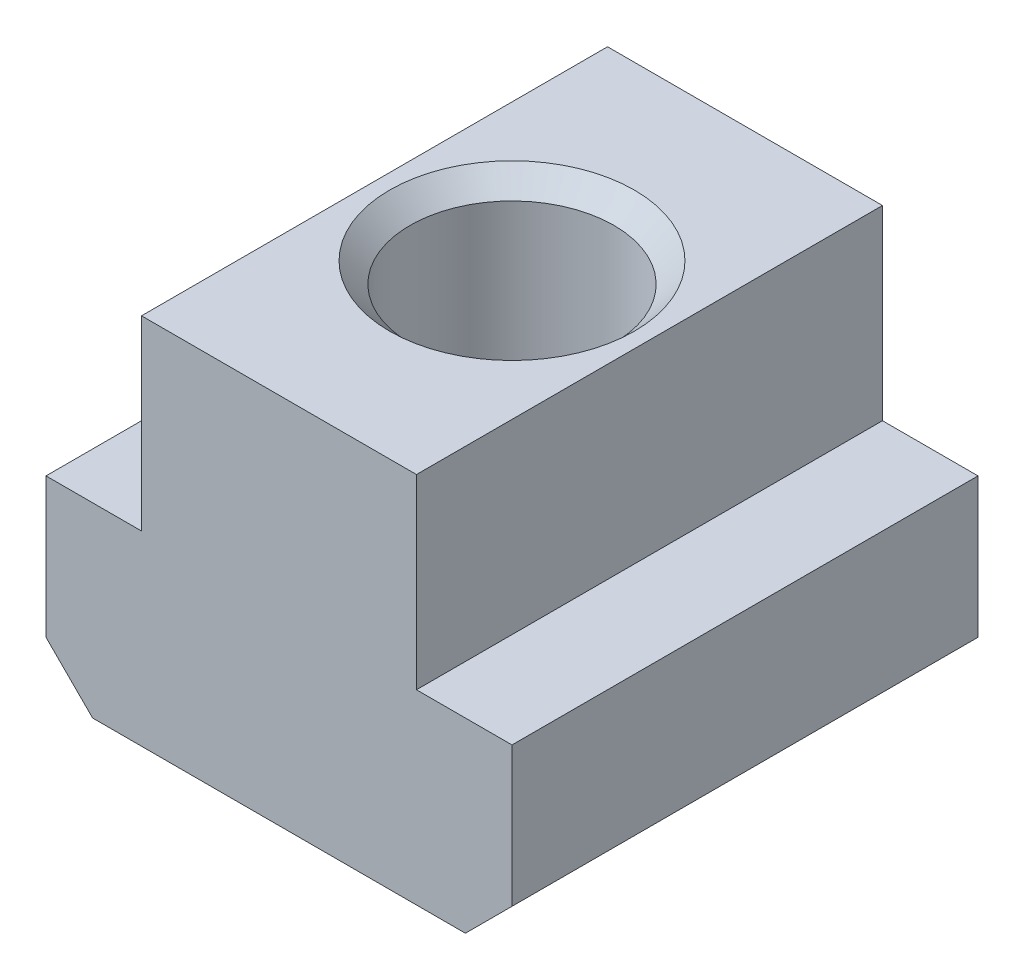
ISO-10303-21;
HEADER;
FILE_DESCRIPTION(('STEP AP214'),'2;1');
FILE_NAME('part.step','',(''),(''),'','','');
FILE_SCHEMA(('AUTOMOTIVE_DESIGN { 1 0 10303 214 1 1 1 1 }'));
ENDSEC;
DATA;
#1=APPLICATION_CONTEXT('core data for automotive mechanical design processes');
#2=APPLICATION_PROTOCOL_DEFINITION('international standard','automotive_design',2000,#1);
#3=PRODUCT_CONTEXT('',#1,'mechanical');
#4=PRODUCT('Part','Part','',(#3));
#5=PRODUCT_RELATED_PRODUCT_CATEGORY('part','',(#4));
#6=PRODUCT_DEFINITION_FORMATION('','',#4);
#7=PRODUCT_DEFINITION_CONTEXT('part definition',#1,'design');
#8=PRODUCT_DEFINITION('design','',#6,#7);
#9=PRODUCT_DEFINITION_SHAPE('','',#8);
#10=(LENGTH_UNIT() NAMED_UNIT(*) SI_UNIT(.MILLI.,.METRE.));
#11=(NAMED_UNIT(*) PLANE_ANGLE_UNIT() SI_UNIT($,.RADIAN.));
#12=(NAMED_UNIT(*) SI_UNIT($,.STERADIAN.) SOLID_ANGLE_UNIT());
#13=UNCERTAINTY_MEASURE_WITH_UNIT(LENGTH_MEASURE(1.E-05),#10,'distance_accuracy_value','');
#14=(GEOMETRIC_REPRESENTATION_CONTEXT(3) GLOBAL_UNCERTAINTY_ASSIGNED_CONTEXT((#13)) GLOBAL_UNIT_ASSIGNED_CONTEXT((#10,
#11,#12)) REPRESENTATION_CONTEXT('',''));
#15=CARTESIAN_POINT('',(0.,0.,0.));
#16=DIRECTION('',(0.,0.,1.));
#17=DIRECTION('',(1.,0.,0.));
#18=AXIS2_PLACEMENT_3D('',#15,#16,#17);
#19=CARTESIAN_POINT('',(20.,0.,20.));
#20=DIRECTION('',(-1.,0.,0.));
#21=DIRECTION('',(0.,-1.,0.));
#22=AXIS2_PLACEMENT_3D('',#19,#20,#21);
#23=PLANE('',#22);
#24=DIRECTION('',(0.,1.,0.));
#25=VECTOR('',#24,1.);
#26=CARTESIAN_POINT('',(20.,0.,20.));
#27=LINE('',#26,#25);
#28=CARTESIAN_POINT('',(20.,-12.,20.));
#29=VERTEX_POINT('',#28);
#30=CARTESIAN_POINT('',(20.,0.,20.));
#31=VERTEX_POINT('',#30);
#32=EDGE_CURVE('E113',#29,#31,#27,.T.);
#33=ORIENTED_EDGE('',*,*,#32,.F.);
#34=DIRECTION('',(0.,0.,-1.));
#35=VECTOR('',#34,1.);
#36=CARTESIAN_POINT('',(20.,-12.,20.));
#37=LINE('',#36,#35);
#38=CARTESIAN_POINT('',(20.,-12.,-20.));
#39=VERTEX_POINT('',#38);
#40=EDGE_CURVE('E11',#29,#39,#37,.T.);
#41=ORIENTED_EDGE('',*,*,#40,.T.);
#42=DIRECTION('',(0.,1.,0.));
#43=VECTOR('',#42,1.);
#44=CARTESIAN_POINT('',(20.,0.,-20.));
#45=LINE('',#44,#43);
#46=CARTESIAN_POINT('',(20.,0.,-20.));
#47=VERTEX_POINT('',#46);
#48=EDGE_CURVE('E133',#39,#47,#45,.T.);
#49=ORIENTED_EDGE('',*,*,#48,.T.);
#50=DIRECTION('',(0.,0.,-1.));
#51=VECTOR('',#50,1.);
#52=CARTESIAN_POINT('',(20.,0.,20.));
#53=LINE('',#52,#51);
#54=EDGE_CURVE('E126',#31,#47,#53,.T.);
#55=ORIENTED_EDGE('',*,*,#54,.F.);
#56=EDGE_LOOP('',(#33,#41,#49,#55));
#57=FACE_BOUND('',#56,.T.);
#58=ADVANCED_FACE('F36',(#57),#23,.F.);
#59=CARTESIAN_POINT('',(11.8,0.,20.));
#60=DIRECTION('',(0.,-1.,0.));
#61=DIRECTION('',(0.,0.,-1.));
#62=AXIS2_PLACEMENT_3D('',#59,#60,#61);
#63=PLANE('',#62);
#64=DIRECTION('',(-1.,0.,0.));
#65=VECTOR('',#64,1.);
#66=CARTESIAN_POINT('',(11.8,0.,-20.));
#67=LINE('',#66,#65);
#68=CARTESIAN_POINT('',(11.8,0.,-20.));
#69=VERTEX_POINT('',#68);
#70=EDGE_CURVE('E199',#47,#69,#67,.T.);
#71=ORIENTED_EDGE('',*,*,#70,.T.);
#72=DIRECTION('',(0.,0.,-1.));
#73=VECTOR('',#72,1.);
#74=CARTESIAN_POINT('',(11.8,0.,20.));
#75=LINE('',#74,#73);
#76=CARTESIAN_POINT('',(11.8,0.,20.));
#77=VERTEX_POINT('',#76);
#78=EDGE_CURVE('E128',#77,#69,#75,.T.);
#79=ORIENTED_EDGE('',*,*,#78,.F.);
#80=DIRECTION('',(-1.,0.,0.));
#81=VECTOR('',#80,1.);
#82=CARTESIAN_POINT('',(11.8,0.,20.));
#83=LINE('',#82,#81);
#84=EDGE_CURVE('E116',#31,#77,#83,.T.);
#85=ORIENTED_EDGE('',*,*,#84,.F.);
#86=ORIENTED_EDGE('',*,*,#54,.T.);
#87=EDGE_LOOP('',(#71,#79,#85,#86));
#88=FACE_BOUND('',#87,.T.);
#89=ADVANCED_FACE('F125',(#88),#63,.F.);
#90=CARTESIAN_POINT('',(11.8,16.,20.));
#91=DIRECTION('',(-1.,0.,0.));
#92=DIRECTION('',(0.,-1.,0.));
#93=AXIS2_PLACEMENT_3D('',#90,#91,#92);
#94=PLANE('',#93);
#95=DIRECTION('',(0.,1.,0.));
#96=VECTOR('',#95,1.);
#97=CARTESIAN_POINT('',(11.8,16.,-20.));
#98=LINE('',#97,#96);
#99=CARTESIAN_POINT('',(11.8,16.,-20.));
#100=VERTEX_POINT('',#99);
#101=EDGE_CURVE('E197',#69,#100,#98,.T.);
#102=ORIENTED_EDGE('',*,*,#101,.T.);
#103=DIRECTION('',(0.,0.,-1.));
#104=VECTOR('',#103,1.);
#105=CARTESIAN_POINT('',(11.8,16.,20.));
#106=LINE('',#105,#104);
#107=CARTESIAN_POINT('',(11.8,16.,20.));
#108=VERTEX_POINT('',#107);
#109=EDGE_CURVE('E139',#108,#100,#106,.T.);
#110=ORIENTED_EDGE('',*,*,#109,.F.);
#111=DIRECTION('',(0.,1.,0.));
#112=VECTOR('',#111,1.);
#113=CARTESIAN_POINT('',(11.8,16.,20.));
#114=LINE('',#113,#112);
#115=EDGE_CURVE('E130',#77,#108,#114,.T.);
#116=ORIENTED_EDGE('',*,*,#115,.F.);
#117=ORIENTED_EDGE('',*,*,#78,.T.);
#118=EDGE_LOOP('',(#102,#110,#116,#117));
#119=FACE_BOUND('',#118,.T.);
#120=ADVANCED_FACE('F225',(#119),#94,.F.);
#121=CARTESIAN_POINT('',(-11.8,16.,20.));
#122=DIRECTION('',(0.,-1.,0.));
#123=DIRECTION('',(0.,0.,-1.));
#124=AXIS2_PLACEMENT_3D('',#121,#122,#123);
#125=PLANE('',#124);
#126=CARTESIAN_POINT('',(0.,16.,0.));
#127=DIRECTION('',(0.,1.,0.));
#128=DIRECTION('',(0.,0.,1.));
#129=AXIS2_PLACEMENT_3D('',#126,#127,#128);
#130=CIRCLE('',#129,10.5);
#131=CARTESIAN_POINT('',(0.,16.,10.5));
#132=VERTEX_POINT('',#131);
#133=EDGE_CURVE('E217',#132,#132,#130,.T.);
#134=ORIENTED_EDGE('',*,*,#133,.F.);
#135=EDGE_LOOP('',(#134));
#136=FACE_BOUND('',#135,.T.);
#137=DIRECTION('',(-1.,0.,0.));
#138=VECTOR('',#137,1.);
#139=CARTESIAN_POINT('',(-11.8,16.,-20.));
#140=LINE('',#139,#138);
#141=CARTESIAN_POINT('',(-11.8,16.,-20.));
#142=VERTEX_POINT('',#141);
#143=EDGE_CURVE('E192',#100,#142,#140,.T.);
#144=ORIENTED_EDGE('',*,*,#143,.T.);
#145=DIRECTION('',(0.,0.,-1.));
#146=VECTOR('',#145,1.);
#147=CARTESIAN_POINT('',(-11.8,16.,20.));
#148=LINE('',#147,#146);
#149=CARTESIAN_POINT('',(-11.8,16.,20.));
#150=VERTEX_POINT('',#149);
#151=EDGE_CURVE('E183',#150,#142,#148,.T.);
#152=ORIENTED_EDGE('',*,*,#151,.F.);
#153=DIRECTION('',(-1.,0.,0.));
#154=VECTOR('',#153,1.);
#155=CARTESIAN_POINT('',(-11.8,16.,20.));
#156=LINE('',#155,#154);
#157=EDGE_CURVE('E193',#108,#150,#156,.T.);
#158=ORIENTED_EDGE('',*,*,#157,.F.);
#159=ORIENTED_EDGE('',*,*,#109,.T.);
#160=EDGE_LOOP('',(#144,#152,#158,#159));
#161=FACE_BOUND('',#160,.T.);
#162=ADVANCED_FACE('F190',(#136,#161),#125,.F.);
#163=CARTESIAN_POINT('',(-11.8,16.,20.));
#164=DIRECTION('',(1.,0.,0.));
#165=DIRECTION('',(0.,1.,0.));
#166=AXIS2_PLACEMENT_3D('',#163,#164,#165);
#167=PLANE('',#166);
#168=DIRECTION('',(0.,-1.,0.));
#169=VECTOR('',#168,1.);
#170=CARTESIAN_POINT('',(-11.8,16.,-20.));
#171=LINE('',#170,#169);
#172=CARTESIAN_POINT('',(-11.8,0.,-20.));
#173=VERTEX_POINT('',#172);
#174=EDGE_CURVE('E175',#142,#173,#171,.T.);
#175=ORIENTED_EDGE('',*,*,#174,.T.);
#176=DIRECTION('',(0.,0.,-1.));
#177=VECTOR('',#176,1.);
#178=CARTESIAN_POINT('',(-11.8,0.,20.));
#179=LINE('',#178,#177);
#180=CARTESIAN_POINT('',(-11.8,0.,20.));
#181=VERTEX_POINT('',#180);
#182=EDGE_CURVE('E180',#181,#173,#179,.T.);
#183=ORIENTED_EDGE('',*,*,#182,.F.);
#184=DIRECTION('',(0.,-1.,0.));
#185=VECTOR('',#184,1.);
#186=CARTESIAN_POINT('',(-11.8,16.,20.));
#187=LINE('',#186,#185);
#188=EDGE_CURVE('E208',#150,#181,#187,.T.);
#189=ORIENTED_EDGE('',*,*,#188,.F.);
#190=ORIENTED_EDGE('',*,*,#151,.T.);
#191=EDGE_LOOP('',(#175,#183,#189,#190));
#192=FACE_BOUND('',#191,.T.);
#193=ADVANCED_FACE('F224',(#192),#167,.F.);
#194=CARTESIAN_POINT('',(-20.,0.,20.));
#195=DIRECTION('',(0.,-1.,0.));
#196=DIRECTION('',(0.,0.,-1.));
#197=AXIS2_PLACEMENT_3D('',#194,#195,#196);
#198=PLANE('',#197);
#199=DIRECTION('',(-1.,0.,0.));
#200=VECTOR('',#199,1.);
#201=CARTESIAN_POINT('',(-20.,0.,-20.));
#202=LINE('',#201,#200);
#203=CARTESIAN_POINT('',(-20.,0.,-20.));
#204=VERTEX_POINT('',#203);
#205=EDGE_CURVE('E172',#173,#204,#202,.T.);
#206=ORIENTED_EDGE('',*,*,#205,.T.);
#207=DIRECTION('',(0.,0.,-1.));
#208=VECTOR('',#207,1.);
#209=CARTESIAN_POINT('',(-20.,0.,20.));
#210=LINE('',#209,#208);
#211=CARTESIAN_POINT('',(-20.,0.,20.));
#212=VERTEX_POINT('',#211);
#213=EDGE_CURVE('E161',#212,#204,#210,.T.);
#214=ORIENTED_EDGE('',*,*,#213,.F.);
#215=DIRECTION('',(-1.,0.,0.));
#216=VECTOR('',#215,1.);
#217=CARTESIAN_POINT('',(-20.,0.,20.));
#218=LINE('',#217,#216);
#219=EDGE_CURVE('E206',#181,#212,#218,.T.);
#220=ORIENTED_EDGE('',*,*,#219,.F.);
#221=ORIENTED_EDGE('',*,*,#182,.T.);
#222=EDGE_LOOP('',(#206,#214,#220,#221));
#223=FACE_BOUND('',#222,.T.);
#224=ADVANCED_FACE('F231',(#223),#198,.F.);
#225=CARTESIAN_POINT('',(-20.,0.,20.));
#226=DIRECTION('',(1.,0.,0.));
#227=DIRECTION('',(0.,1.,0.));
#228=AXIS2_PLACEMENT_3D('',#225,#226,#227);
#229=PLANE('',#228);
#230=DIRECTION('',(0.,-1.,0.));
#231=VECTOR('',#230,1.);
#232=CARTESIAN_POINT('',(-20.,0.,-20.));
#233=LINE('',#232,#231);
#234=CARTESIAN_POINT('',(-20.,-12.,-20.));
#235=VERTEX_POINT('',#234);
#236=EDGE_CURVE('E168',#204,#235,#233,.T.);
#237=ORIENTED_EDGE('',*,*,#236,.T.);
#238=DIRECTION('',(0.,0.,1.));
#239=VECTOR('',#238,1.);
#240=CARTESIAN_POINT('',(-20.,-12.,20.));
#241=LINE('',#240,#239);
#242=CARTESIAN_POINT('',(-20.,-12.,20.));
#243=VERTEX_POINT('',#242);
#244=EDGE_CURVE('E59',#235,#243,#241,.T.);
#245=ORIENTED_EDGE('',*,*,#244,.T.);
#246=DIRECTION('',(0.,-1.,0.));
#247=VECTOR('',#246,1.);
#248=CARTESIAN_POINT('',(-20.,0.,20.));
#249=LINE('',#248,#247);
#250=EDGE_CURVE('E153',#212,#243,#249,.T.);
#251=ORIENTED_EDGE('',*,*,#250,.F.);
#252=ORIENTED_EDGE('',*,*,#213,.T.);
#253=EDGE_LOOP('',(#237,#245,#251,#252));
#254=FACE_BOUND('',#253,.T.);
#255=ADVANCED_FACE('F170',(#254),#229,.F.);
#256=CARTESIAN_POINT('',(-20.,-16.,20.));
#257=DIRECTION('',(0.,1.,0.));
#258=DIRECTION('',(0.,0.,1.));
#259=AXIS2_PLACEMENT_3D('',#256,#257,#258);
#260=PLANE('',#259);
#261=CARTESIAN_POINT('',(0.,-16.,0.));
#262=DIRECTION('',(0.,1.,0.));
#263=DIRECTION('',(0.,0.,1.));
#264=AXIS2_PLACEMENT_3D('',#261,#262,#263);
#265=CIRCLE('',#264,8.74999999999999);
#266=CARTESIAN_POINT('',(0.,-16.,8.74999999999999));
#267=VERTEX_POINT('',#266);
#268=EDGE_CURVE('E203',#267,#267,#265,.T.);
#269=ORIENTED_EDGE('',*,*,#268,.T.);
#270=EDGE_LOOP('',(#269));
#271=FACE_BOUND('',#270,.T.);
#272=DIRECTION('',(1.,0.,0.));
#273=VECTOR('',#272,1.);
#274=CARTESIAN_POINT('',(-20.,-16.,20.));
#275=LINE('',#274,#273);
#276=CARTESIAN_POINT('',(-16.,-16.,20.));
#277=VERTEX_POINT('',#276);
#278=CARTESIAN_POINT('',(16.,-16.,20.));
#279=VERTEX_POINT('',#278);
#280=EDGE_CURVE('E152',#277,#279,#275,.T.);
#281=ORIENTED_EDGE('',*,*,#280,.F.);
#282=DIRECTION('',(0.,0.,-1.));
#283=VECTOR('',#282,1.);
#284=CARTESIAN_POINT('',(-16.,-16.,20.));
#285=LINE('',#284,#283);
#286=CARTESIAN_POINT('',(-16.,-16.,-20.));
#287=VERTEX_POINT('',#286);
#288=EDGE_CURVE('E137',#277,#287,#285,.T.);
#289=ORIENTED_EDGE('',*,*,#288,.T.);
#290=DIRECTION('',(1.,0.,0.));
#291=VECTOR('',#290,1.);
#292=CARTESIAN_POINT('',(-20.,-16.,-20.));
#293=LINE('',#292,#291);
#294=CARTESIAN_POINT('',(16.,-16.,-20.));
#295=VERTEX_POINT('',#294);
#296=EDGE_CURVE('E121',#287,#295,#293,.T.);
#297=ORIENTED_EDGE('',*,*,#296,.T.);
#298=DIRECTION('',(0.,0.,1.));
#299=VECTOR('',#298,1.);
#300=CARTESIAN_POINT('',(16.,-16.,20.));
#301=LINE('',#300,#299);
#302=EDGE_CURVE('E135',#295,#279,#301,.T.);
#303=ORIENTED_EDGE('',*,*,#302,.T.);
#304=EDGE_LOOP('',(#281,#289,#297,#303));
#305=FACE_BOUND('',#304,.T.);
#306=ADVANCED_FACE('F157',(#271,#305),#260,.F.);
#307=CARTESIAN_POINT('',(0.,0.,20.));
#308=DIRECTION('',(0.,0.,1.));
#309=DIRECTION('',(1.,0.,0.));
#310=AXIS2_PLACEMENT_3D('',#307,#308,#309);
#311=PLANE('',#310);
#312=ORIENTED_EDGE('',*,*,#250,.T.);
#313=DIRECTION('',(-0.707106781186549,0.707106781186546,0.));
#314=VECTOR('',#313,1.);
#315=CARTESIAN_POINT('',(-16.,-16.,20.));
#316=LINE('',#315,#314);
#317=EDGE_CURVE('E44',#243,#277,#316,.F.);
#318=ORIENTED_EDGE('',*,*,#317,.T.);
#319=ORIENTED_EDGE('',*,*,#280,.T.);
#320=DIRECTION('',(-0.707106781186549,-0.707106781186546,0.));
#321=VECTOR('',#320,1.);
#322=CARTESIAN_POINT('',(16.,-16.,20.));
#323=LINE('',#322,#321);
#324=EDGE_CURVE('E51',#279,#29,#323,.F.);
#325=ORIENTED_EDGE('',*,*,#324,.T.);
#326=ORIENTED_EDGE('',*,*,#32,.T.);
#327=ORIENTED_EDGE('',*,*,#84,.T.);
#328=ORIENTED_EDGE('',*,*,#115,.T.);
#329=ORIENTED_EDGE('',*,*,#157,.T.);
#330=ORIENTED_EDGE('',*,*,#188,.T.);
#331=ORIENTED_EDGE('',*,*,#219,.T.);
#332=EDGE_LOOP('',(#312,#318,#319,#325,#326,#327,#328,#329,#330,#331));
#333=FACE_BOUND('',#332,.T.);
#334=ADVANCED_FACE('F115',(#333),#311,.T.);
#335=CARTESIAN_POINT('',(0.,0.,-20.));
#336=DIRECTION('',(0.,0.,1.));
#337=DIRECTION('',(1.,0.,0.));
#338=AXIS2_PLACEMENT_3D('',#335,#336,#337);
#339=PLANE('',#338);
#340=ORIENTED_EDGE('',*,*,#296,.F.);
#341=DIRECTION('',(0.707106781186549,-0.707106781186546,0.));
#342=VECTOR('',#341,1.);
#343=CARTESIAN_POINT('',(-16.,-16.,-20.));
#344=LINE('',#343,#342);
#345=EDGE_CURVE('E147',#287,#235,#344,.F.);
#346=ORIENTED_EDGE('',*,*,#345,.T.);
#347=ORIENTED_EDGE('',*,*,#236,.F.);
#348=ORIENTED_EDGE('',*,*,#205,.F.);
#349=ORIENTED_EDGE('',*,*,#174,.F.);
#350=ORIENTED_EDGE('',*,*,#143,.F.);
#351=ORIENTED_EDGE('',*,*,#101,.F.);
#352=ORIENTED_EDGE('',*,*,#70,.F.);
#353=ORIENTED_EDGE('',*,*,#48,.F.);
#354=DIRECTION('',(0.707106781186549,0.707106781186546,0.));
#355=VECTOR('',#354,1.);
#356=CARTESIAN_POINT('',(20.,-12.,-20.));
#357=LINE('',#356,#355);
#358=EDGE_CURVE('E145',#39,#295,#357,.F.);
#359=ORIENTED_EDGE('',*,*,#358,.T.);
#360=EDGE_LOOP('',(#340,#346,#347,#348,#349,#350,#351,#352,#353,#359));
#361=FACE_BOUND('',#360,.T.);
#362=ADVANCED_FACE('F166',(#361),#339,.F.);
#363=CARTESIAN_POINT('',(0.,16.,0.));
#364=DIRECTION('',(0.,1.,0.));
#365=DIRECTION('',(0.,0.,1.));
#366=AXIS2_PLACEMENT_3D('',#363,#364,#365);
#367=CYLINDRICAL_SURFACE('',#366,8.74999999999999);
#368=ORIENTED_EDGE('',*,*,#268,.F.);
#369=EDGE_LOOP('',(#368));
#370=FACE_BOUND('',#369,.T.);
#371=CARTESIAN_POINT('',(0.,14.25,0.));
#372=DIRECTION('',(0.,1.,0.));
#373=DIRECTION('',(0.,0.,1.));
#374=AXIS2_PLACEMENT_3D('',#371,#372,#373);
#375=CIRCLE('',#374,8.74999999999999);
#376=CARTESIAN_POINT('',(0.,14.25,8.74999999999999));
#377=VERTEX_POINT('',#376);
#378=EDGE_CURVE('E214',#377,#377,#375,.T.);
#379=ORIENTED_EDGE('',*,*,#378,.T.);
#380=EDGE_LOOP('',(#379));
#381=FACE_BOUND('',#380,.T.);
#382=ADVANCED_FACE('F247',(#370,#381),#367,.F.);
#383=CARTESIAN_POINT('',(0.,16.,0.));
#384=DIRECTION('',(0.,1.,0.));
#385=DIRECTION('',(0.,0.,1.));
#386=AXIS2_PLACEMENT_3D('',#383,#384,#385);
#387=CONICAL_SURFACE('',#386,10.5,0.78539816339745);
#388=ORIENTED_EDGE('',*,*,#378,.F.);
#389=EDGE_LOOP('',(#388));
#390=FACE_BOUND('',#389,.T.);
#391=ORIENTED_EDGE('',*,*,#133,.T.);
#392=EDGE_LOOP('',(#391));
#393=FACE_BOUND('',#392,.T.);
#394=ADVANCED_FACE('F221',(#390,#393),#387,.F.);
#395=CARTESIAN_POINT('',(-16.,-16.,20.));
#396=DIRECTION('',(0.707106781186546,0.707106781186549,0.));
#397=DIRECTION('',(0.,0.,-1.));
#398=AXIS2_PLACEMENT_3D('',#395,#396,#397);
#399=PLANE('',#398);
#400=ORIENTED_EDGE('',*,*,#317,.F.);
#401=ORIENTED_EDGE('',*,*,#244,.F.);
#402=ORIENTED_EDGE('',*,*,#345,.F.);
#403=ORIENTED_EDGE('',*,*,#288,.F.);
#404=EDGE_LOOP('',(#400,#401,#402,#403));
#405=FACE_BOUND('',#404,.T.);
#406=ADVANCED_FACE('F163',(#405),#399,.F.);
#407=CARTESIAN_POINT('',(20.,-12.,20.));
#408=DIRECTION('',(-0.707106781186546,0.707106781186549,0.));
#409=DIRECTION('',(0.,0.,-1.));
#410=AXIS2_PLACEMENT_3D('',#407,#408,#409);
#411=PLANE('',#410);
#412=ORIENTED_EDGE('',*,*,#324,.F.);
#413=ORIENTED_EDGE('',*,*,#302,.F.);
#414=ORIENTED_EDGE('',*,*,#358,.F.);
#415=ORIENTED_EDGE('',*,*,#40,.F.);
#416=EDGE_LOOP('',(#412,#413,#414,#415));
#417=FACE_BOUND('',#416,.T.);
#418=ADVANCED_FACE('F38',(#417),#411,.F.);
#419=CLOSED_SHELL('',(#58,#89,#120,#162,#193,#224,#255,#306,#334,#362,#382,#394,#406,#418));
#420=MANIFOLD_SOLID_BREP('B2',#419);
#421=ADVANCED_BREP_SHAPE_REPRESENTATION('',(#18,#420),#14);
#422=SHAPE_DEFINITION_REPRESENTATION(#9,#421);
ENDSEC;
END-ISO-10303-21;
